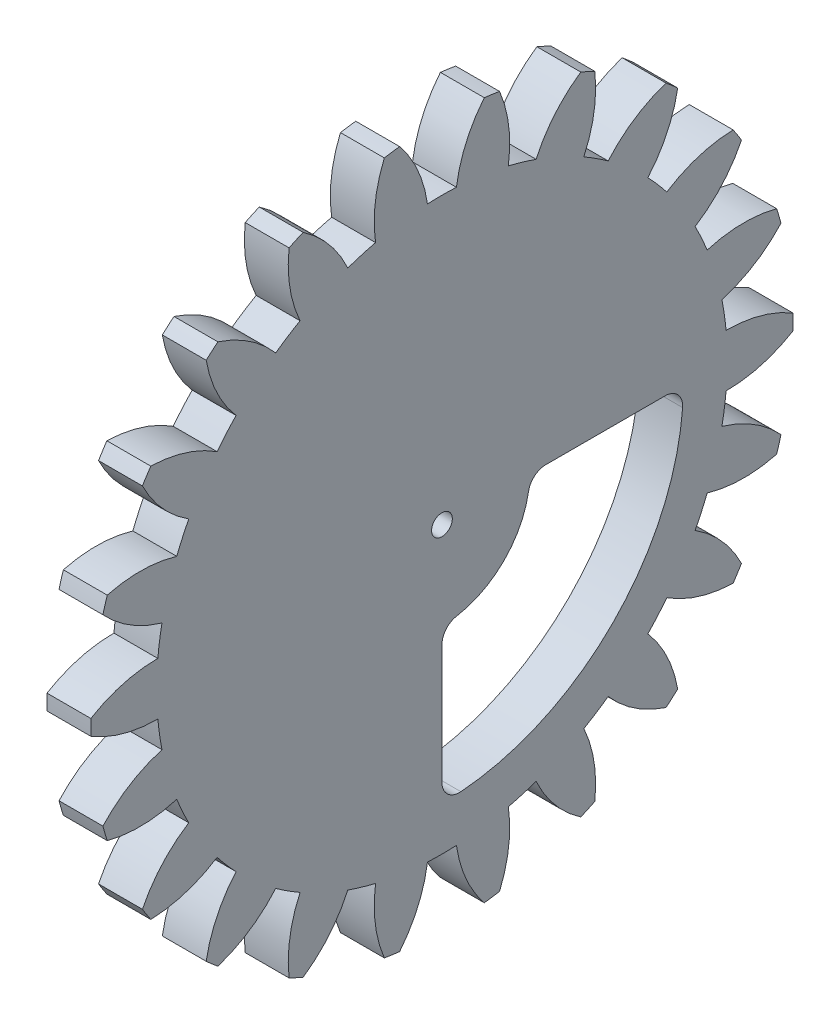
from build123d import *

# Parameters (mm, degrees)
BASPROSKE_W         = 6.35
BASPROSKE_H         = 50.8
TOOTHCUT_DEPTH      = 73.122135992
TEETHCUTS_COUNT     = 22
TEETHCUTS_ANGLE     = 343.636363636
BORSKE_R            = 3.175
BORE_DEPTH          = 50.8006096
SKETCH1_R           = 3.175
SKETCH1_R_2         = 1.5
BOSS_EXTRUDE1_DEPTH = 6.35
CUT_EXTRUDE1_DEPTH  = 72.861896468
FILLET1_R           = 2.54


with BuildPart() as part:
    # BasProSke → Base-Revolve (revolve)
    with BuildSketch(Plane(origin=(0, 0, 0), x_dir=(1, 0, 0), z_dir=(0, 1, 0)), mode=Mode.PRIVATE) as base_revolve_sk:
        with Locations((3.175, 25.4)):
            Rectangle(BASPROSKE_W, BASPROSKE_H)
    revolve(base_revolve_sk.sketch.rotate(Axis((-10, 0, 0), (1, 0, 0)), 180), axis=Axis((-10, 0, 0), (1, 0, 0)))

    # TooCutSke → ToothCut (cut, through all)
    with BuildSketch(Plane(origin=(0, 0, 0), x_dir=(0, 0, -1), z_dir=(1, 0, 0))):
        with BuildLine():
            ThreePointArc((2.093443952, 41.220605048), (0, 41.27373), (-2.093443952, 41.220605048))
            ThreePointArc((-2.093443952, 41.220605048), (-3.480467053, 46.115833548), (-6.140363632, 50.453119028))
            ThreePointArc((-6.140363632, 50.453119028), (0, 50.8254), (6.140363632, 50.453119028))
            ThreePointArc((6.140363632, 50.453119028), (3.480467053, 46.115833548), (2.093443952, 41.220605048))
        make_face()
    toothcut = extrude(amount=TOOTHCUT_DEPTH, mode=Mode.SUBTRACT)

    # TeethCuts: ToothCut ×22 about axis
    teethcuts_axis = Axis((-10, 0, 0), (1, 0, 0))
    for i in range(1, TEETHCUTS_COUNT):
        add(toothcut.rotate(teethcuts_axis, i * TEETHCUTS_ANGLE / (TEETHCUTS_COUNT - 1)), mode=Mode.SUBTRACT)

    # BorSke → Bore (cut, symmetric)
    with BuildSketch(Plane(origin=(0, 0, 0), x_dir=(0, 0, -1), z_dir=(1, 0, 0))):
        with Locations(Location((0, 0, 0), (0, 0, 180))):
            Circle(BORSKE_R)
    extrude(amount=BORE_DEPTH, both=True, mode=Mode.SUBTRACT)

    # Sketch1 → Boss-Extrude1 (add)
    with BuildSketch(Plane(origin=(6.35, 0, 0), x_dir=(0, 0, -1), z_dir=(1, 0, 0))):
        Circle(SKETCH1_R)
        Circle(SKETCH1_R_2, mode=Mode.SUBTRACT)
    extrude(amount=-BOSS_EXTRUDE1_DEPTH)

    # Sketch2 → Cut-Extrude1 (cut, through all)
    with BuildSketch(Plane(origin=(6.35, 0, 0), x_dir=(0, 0, -1), z_dir=(1, 0, 0))):
        with BuildLine():
            Line((0, -12.7), (0, -34.925))
            ThreePointArc((0, -34.925), (24.695704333, -24.695704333), (34.925, 0))
            Line((34.925, 0), (12.7, 0))
            ThreePointArc((12.7, 0), (8.980256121, -8.980256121), (0, -12.7))
        make_face()
    extrude(amount=-CUT_EXTRUDE1_DEPTH, mode=Mode.SUBTRACT)

    # Fillet1
    fillet1_edges = [part.edges().sort_by_distance(p)[0] for p in [
        (3.175, -12.7, 0),
        (3.175, 0, -12.7),
        (3.175, 0, -34.925),
        (3.175, -34.925, 0),
    ]]
    fillet(fillet1_edges, radius=FILLET1_R)


solid = part.part
